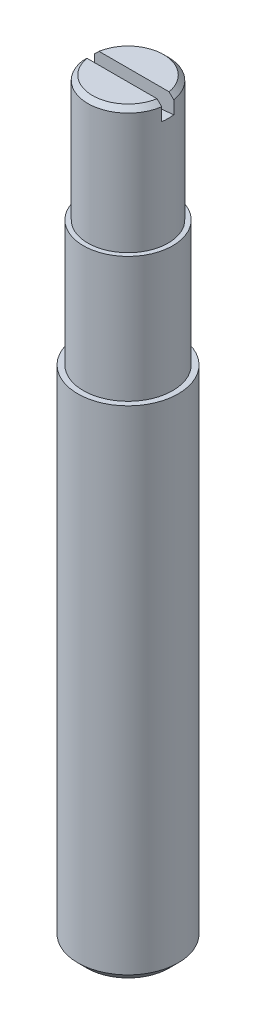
ISO-10303-21;
HEADER;
FILE_DESCRIPTION(('STEP AP214'),'2;1');
FILE_NAME('part.step','',(''),(''),'','','');
FILE_SCHEMA(('AUTOMOTIVE_DESIGN { 1 0 10303 214 1 1 1 1 }'));
ENDSEC;
DATA;
#1=APPLICATION_CONTEXT('core data for automotive mechanical design processes');
#2=APPLICATION_PROTOCOL_DEFINITION('international standard','automotive_design',2000,#1);
#3=PRODUCT_CONTEXT('',#1,'mechanical');
#4=PRODUCT('Part','Part','',(#3));
#5=PRODUCT_RELATED_PRODUCT_CATEGORY('part','',(#4));
#6=PRODUCT_DEFINITION_FORMATION('','',#4);
#7=PRODUCT_DEFINITION_CONTEXT('part definition',#1,'design');
#8=PRODUCT_DEFINITION('design','',#6,#7);
#9=PRODUCT_DEFINITION_SHAPE('','',#8);
#10=(LENGTH_UNIT() NAMED_UNIT(*) SI_UNIT(.MILLI.,.METRE.));
#11=(NAMED_UNIT(*) PLANE_ANGLE_UNIT() SI_UNIT($,.RADIAN.));
#12=(NAMED_UNIT(*) SI_UNIT($,.STERADIAN.) SOLID_ANGLE_UNIT());
#13=UNCERTAINTY_MEASURE_WITH_UNIT(LENGTH_MEASURE(1.E-05),#10,'distance_accuracy_value','');
#14=(GEOMETRIC_REPRESENTATION_CONTEXT(3) GLOBAL_UNCERTAINTY_ASSIGNED_CONTEXT((#13)) GLOBAL_UNIT_ASSIGNED_CONTEXT((#10,
#11,#12)) REPRESENTATION_CONTEXT('',''));
#15=CARTESIAN_POINT('',(0.,0.,0.));
#16=DIRECTION('',(0.,0.,1.));
#17=DIRECTION('',(1.,0.,0.));
#18=AXIS2_PLACEMENT_3D('',#15,#16,#17);
#19=CARTESIAN_POINT('',(0.,50.,0.));
#20=DIRECTION('',(0.,-1.,0.));
#21=DIRECTION('',(0.,0.,-1.));
#22=AXIS2_PLACEMENT_3D('',#19,#20,#21);
#23=PLANE('',#22);
#24=CARTESIAN_POINT('',(0.,50.0000000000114,0.));
#25=DIRECTION('',(0.,-1.,0.));
#26=DIRECTION('',(0.,0.,-1.));
#27=AXIS2_PLACEMENT_3D('',#24,#25,#26);
#28=CIRCLE('',#27,3.53999999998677);
#29=CARTESIAN_POINT('',(-3.48878202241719,50.0000000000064,-0.6));
#30=VERTEX_POINT('',#29);
#31=CARTESIAN_POINT('',(3.48878202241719,50.0000000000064,-0.6));
#32=VERTEX_POINT('',#31);
#33=EDGE_CURVE('E165',#30,#32,#28,.T.);
#34=ORIENTED_EDGE('',*,*,#33,.F.);
#35=DIRECTION('',(1.,0.,0.));
#36=VECTOR('',#35,1.);
#37=CARTESIAN_POINT('',(0.,50.,-0.6));
#38=LINE('',#37,#36);
#39=EDGE_CURVE('E163',#32,#30,#38,.F.);
#40=ORIENTED_EDGE('',*,*,#39,.F.);
#41=EDGE_LOOP('',(#34,#40));
#42=FACE_BOUND('',#41,.T.);
#43=ADVANCED_FACE('F14',(#42),#23,.F.);
#44=CARTESIAN_POINT('',(0.,50.,0.));
#45=DIRECTION('',(0.,-1.,0.));
#46=DIRECTION('',(0.,0.,-1.));
#47=AXIS2_PLACEMENT_3D('',#44,#45,#46);
#48=PLANE('',#47);
#49=DIRECTION('',(1.,0.,0.));
#50=VECTOR('',#49,1.);
#51=CARTESIAN_POINT('',(0.,50.,0.6));
#52=LINE('',#51,#50);
#53=CARTESIAN_POINT('',(-3.48878202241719,50.0000000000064,0.6));
#54=VERTEX_POINT('',#53);
#55=CARTESIAN_POINT('',(3.48878202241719,50.0000000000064,0.6));
#56=VERTEX_POINT('',#55);
#57=EDGE_CURVE('E161',#54,#56,#52,.T.);
#58=ORIENTED_EDGE('',*,*,#57,.F.);
#59=CARTESIAN_POINT('',(0.,50.0000000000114,0.));
#60=DIRECTION('',(0.,-1.,0.));
#61=DIRECTION('',(0.,0.,-1.));
#62=AXIS2_PLACEMENT_3D('',#59,#60,#61);
#63=CIRCLE('',#62,3.53999999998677);
#64=EDGE_CURVE('E159',#56,#54,#63,.T.);
#65=ORIENTED_EDGE('',*,*,#64,.F.);
#66=EDGE_LOOP('',(#58,#65));
#67=FACE_BOUND('',#66,.T.);
#68=ADVANCED_FACE('F121',(#67),#48,.F.);
#69=CARTESIAN_POINT('',(0.,49.5399999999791,0.));
#70=DIRECTION('',(0.,-1.,0.));
#71=DIRECTION('',(0.,0.,-1.));
#72=AXIS2_PLACEMENT_3D('',#69,#70,#71);
#73=CONICAL_SURFACE('',#72,3.99999999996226,0.785398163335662);
#74=CARTESIAN_POINT('',(-3.48878202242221,50.0000000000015,-0.6));
#75=CARTESIAN_POINT('',(-3.56650335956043,49.9233951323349,-0.6));
#76=CARTESIAN_POINT('',(-3.64419419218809,49.8467593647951,-0.6));
#77=CARTESIAN_POINT('',(-3.79951484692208,49.6934260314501,-0.6));
#78=CARTESIAN_POINT('',(-3.87714466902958,49.6167284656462,-0.6));
#79=CARTESIAN_POINT('',(-3.9547439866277,49.5399999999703,-0.6));
#80=B_SPLINE_CURVE_WITH_KNOTS('',3,(#74,#75,#76,#77,#78,#79),.UNSPECIFIED.,.F.,.F.,(4,2,4),(0.,
0.327383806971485,0.654767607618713),.UNSPECIFIED.);
#81=CARTESIAN_POINT('',(-3.95474398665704,49.5399999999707,-0.6));
#82=VERTEX_POINT('',#81);
#83=EDGE_CURVE('E39',#30,#82,#80,.T.);
#84=ORIENTED_EDGE('',*,*,#83,.F.);
#85=ORIENTED_EDGE('',*,*,#33,.T.);
#86=CARTESIAN_POINT('',(3.95474398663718,49.5399999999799,-0.600000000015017));
#87=CARTESIAN_POINT('',(3.87714466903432,49.616728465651,-0.600000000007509));
#88=CARTESIAN_POINT('',(3.79951484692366,49.6934260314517,-0.600000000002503));
#89=CARTESIAN_POINT('',(3.64419419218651,49.8467593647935,-0.599999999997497));
#90=CARTESIAN_POINT('',(3.56650335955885,49.9233951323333,-0.599999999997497));
#91=CARTESIAN_POINT('',(3.48878202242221,50.0000000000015,-0.6));
#92=B_SPLINE_CURVE_WITH_KNOTS('',3,(#86,#87,#88,#89,#90,#91),.UNSPECIFIED.,.F.,.F.,(4,2,4),(0.,
0.327383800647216,0.654767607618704),.UNSPECIFIED.);
#93=CARTESIAN_POINT('',(3.95474398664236,49.5399999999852,-0.6));
#94=VERTEX_POINT('',#93);
#95=EDGE_CURVE('E134',#94,#32,#92,.T.);
#96=ORIENTED_EDGE('',*,*,#95,.F.);
#97=CARTESIAN_POINT('',(0.,49.54,0.));
#98=DIRECTION('',(0.,-1.,0.));
#99=DIRECTION('',(0.,0.,-1.));
#100=AXIS2_PLACEMENT_3D('',#97,#98,#99);
#101=CIRCLE('',#100,4.);
#102=EDGE_CURVE('E175',#82,#94,#101,.T.);
#103=ORIENTED_EDGE('',*,*,#102,.F.);
#104=EDGE_LOOP('',(#84,#85,#96,#103));
#105=FACE_BOUND('',#104,.T.);
#106=ADVANCED_FACE('F116',(#105),#73,.T.);
#107=CARTESIAN_POINT('',(0.,79.5,-0.6));
#108=DIRECTION('',(0.,0.,1.));
#109=DIRECTION('',(1.,0.,0.));
#110=AXIS2_PLACEMENT_3D('',#107,#108,#109);
#111=PLANE('',#110);
#112=ORIENTED_EDGE('',*,*,#39,.T.);
#113=ORIENTED_EDGE('',*,*,#83,.T.);
#114=DIRECTION('',(0.,1.,0.));
#115=VECTOR('',#114,1.);
#116=CARTESIAN_POINT('',(-3.95474398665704,79.5,-0.6));
#117=LINE('',#116,#115);
#118=CARTESIAN_POINT('',(-3.95474398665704,48.2492400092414,-0.6));
#119=VERTEX_POINT('',#118);
#120=EDGE_CURVE('E154',#82,#119,#117,.F.);
#121=ORIENTED_EDGE('',*,*,#120,.T.);
#122=CARTESIAN_POINT('',(0.,79.5,-0.6));
#123=DIRECTION('',(0.,0.,-1.));
#124=DIRECTION('',(-1.,0.,0.));
#125=AXIS2_PLACEMENT_3D('',#122,#123,#124);
#126=CIRCLE('',#125,31.5);
#127=CARTESIAN_POINT('',(3.95474398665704,48.2492400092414,-0.6));
#128=VERTEX_POINT('',#127);
#129=EDGE_CURVE('E89',#119,#128,#126,.F.);
#130=ORIENTED_EDGE('',*,*,#129,.T.);
#131=DIRECTION('',(0.,1.,0.));
#132=VECTOR('',#131,1.);
#133=CARTESIAN_POINT('',(3.95474398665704,79.5,-0.6));
#134=LINE('',#133,#132);
#135=EDGE_CURVE('E140',#128,#94,#134,.T.);
#136=ORIENTED_EDGE('',*,*,#135,.T.);
#137=ORIENTED_EDGE('',*,*,#95,.T.);
#138=EDGE_LOOP('',(#112,#113,#121,#130,#136,#137));
#139=FACE_BOUND('',#138,.T.);
#140=ADVANCED_FACE('F120',(#139),#111,.T.);
#141=CARTESIAN_POINT('',(0.,49.5399999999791,0.));
#142=DIRECTION('',(0.,-1.,0.));
#143=DIRECTION('',(0.,0.,-1.));
#144=AXIS2_PLACEMENT_3D('',#141,#142,#143);
#145=CONICAL_SURFACE('',#144,3.99999999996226,0.785398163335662);
#146=ORIENTED_EDGE('',*,*,#64,.T.);
#147=CARTESIAN_POINT('',(-3.48878202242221,50.0000000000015,0.6));
#148=CARTESIAN_POINT('',(-3.56650335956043,49.9233951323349,0.6));
#149=CARTESIAN_POINT('',(-3.64419419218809,49.8467593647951,0.6));
#150=CARTESIAN_POINT('',(-3.79951484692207,49.6934260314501,0.6));
#151=CARTESIAN_POINT('',(-3.87714466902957,49.6167284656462,0.6));
#152=CARTESIAN_POINT('',(-3.95474398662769,49.5399999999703,0.6));
#153=B_SPLINE_CURVE_WITH_KNOTS('',3,(#147,#148,#149,#150,#151,#152),.UNSPECIFIED.,.F.,.F.,(4,2,
4),(0.,0.327383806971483,0.654767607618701),.UNSPECIFIED.);
#154=CARTESIAN_POINT('',(-3.95474398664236,49.5399999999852,0.6));
#155=VERTEX_POINT('',#154);
#156=EDGE_CURVE('E149',#54,#155,#153,.T.);
#157=ORIENTED_EDGE('',*,*,#156,.T.);
#158=CARTESIAN_POINT('',(0.,49.54,0.));
#159=DIRECTION('',(0.,-1.,0.));
#160=DIRECTION('',(0.,0.,-1.));
#161=AXIS2_PLACEMENT_3D('',#158,#159,#160);
#162=CIRCLE('',#161,4.);
#163=CARTESIAN_POINT('',(3.95474398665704,49.5399999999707,0.6));
#164=VERTEX_POINT('',#163);
#165=EDGE_CURVE('E79',#164,#155,#162,.T.);
#166=ORIENTED_EDGE('',*,*,#165,.F.);
#167=CARTESIAN_POINT('',(3.95474398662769,49.5399999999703,0.6));
#168=CARTESIAN_POINT('',(3.87714466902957,49.6167284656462,0.6));
#169=CARTESIAN_POINT('',(3.79951484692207,49.6934260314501,0.6));
#170=CARTESIAN_POINT('',(3.64419419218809,49.8467593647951,0.6));
#171=CARTESIAN_POINT('',(3.56650335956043,49.9233951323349,0.6));
#172=CARTESIAN_POINT('',(3.48878202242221,50.0000000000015,0.6));
#173=B_SPLINE_CURVE_WITH_KNOTS('',3,(#167,#168,#169,#170,#171,#172),.UNSPECIFIED.,.F.,.F.,(4,2,
4),(0.,0.327383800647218,0.654767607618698),.UNSPECIFIED.);
#174=EDGE_CURVE('E97',#164,#56,#173,.T.);
#175=ORIENTED_EDGE('',*,*,#174,.T.);
#176=EDGE_LOOP('',(#146,#157,#166,#175));
#177=FACE_BOUND('',#176,.T.);
#178=ADVANCED_FACE('F122',(#177),#145,.T.);
#179=CARTESIAN_POINT('',(0.,79.5,0.6));
#180=DIRECTION('',(0.,0.,1.));
#181=DIRECTION('',(1.,0.,0.));
#182=AXIS2_PLACEMENT_3D('',#179,#180,#181);
#183=PLANE('',#182);
#184=ORIENTED_EDGE('',*,*,#57,.T.);
#185=ORIENTED_EDGE('',*,*,#174,.F.);
#186=DIRECTION('',(0.,1.,0.));
#187=VECTOR('',#186,1.);
#188=CARTESIAN_POINT('',(3.95474398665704,79.5,0.6));
#189=LINE('',#188,#187);
#190=CARTESIAN_POINT('',(3.95474398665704,48.2492400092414,0.6));
#191=VERTEX_POINT('',#190);
#192=EDGE_CURVE('E95',#191,#164,#189,.T.);
#193=ORIENTED_EDGE('',*,*,#192,.F.);
#194=CARTESIAN_POINT('',(0.,79.5,0.6));
#195=DIRECTION('',(0.,0.,-1.));
#196=DIRECTION('',(-1.,0.,0.));
#197=AXIS2_PLACEMENT_3D('',#194,#195,#196);
#198=CIRCLE('',#197,31.5);
#199=CARTESIAN_POINT('',(-3.95474398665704,48.2492400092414,0.6));
#200=VERTEX_POINT('',#199);
#201=EDGE_CURVE('E82',#200,#191,#198,.F.);
#202=ORIENTED_EDGE('',*,*,#201,.F.);
#203=DIRECTION('',(0.,1.,0.));
#204=VECTOR('',#203,1.);
#205=CARTESIAN_POINT('',(-3.95474398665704,79.5,0.6));
#206=LINE('',#205,#204);
#207=EDGE_CURVE('E73',#155,#200,#206,.F.);
#208=ORIENTED_EDGE('',*,*,#207,.F.);
#209=ORIENTED_EDGE('',*,*,#156,.F.);
#210=EDGE_LOOP('',(#184,#185,#193,#202,#208,#209));
#211=FACE_BOUND('',#210,.T.);
#212=ADVANCED_FACE('F93',(#211),#183,.F.);
#213=CARTESIAN_POINT('',(0.,79.5,0.6));
#214=DIRECTION('',(0.,0.,-1.));
#215=DIRECTION('',(-1.,0.,0.));
#216=AXIS2_PLACEMENT_3D('',#213,#214,#215);
#217=CYLINDRICAL_SURFACE('',#216,31.5);
#218=CARTESIAN_POINT('',(3.95474398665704,48.2492400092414,-0.6));
#219=CARTESIAN_POINT('',(3.96984984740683,48.2511544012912,-0.500484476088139));
#220=CARTESIAN_POINT('',(3.98118553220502,48.2525972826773,-0.40038868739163));
#221=CARTESIAN_POINT('',(3.9962389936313,48.2545175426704,-0.20019306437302));
#222=CARTESIAN_POINT('',(4.,48.2550004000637,-0.10009653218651));
#223=CARTESIAN_POINT('',(4.,48.2550004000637,0.10009653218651));
#224=CARTESIAN_POINT('',(3.9962389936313,48.2545175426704,0.20019306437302));
#225=CARTESIAN_POINT('',(3.98118553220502,48.2525972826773,0.40038868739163));
#226=CARTESIAN_POINT('',(3.96984984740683,48.2511544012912,0.500484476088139));
#227=CARTESIAN_POINT('',(3.95474398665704,48.2492400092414,0.6));
#228=B_SPLINE_CURVE_WITH_KNOTS('',3,(#218,#219,#220,#221,#222,#223,#224,#225,#226,#227),
.UNSPECIFIED.,.F.,.F.,(4,2,2,2,4),(0.,0.301946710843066,0.602165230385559,0.902383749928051,
1.20433046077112),.UNSPECIFIED.);
#229=EDGE_CURVE('E83',#128,#191,#228,.T.);
#230=ORIENTED_EDGE('',*,*,#229,.F.);
#231=ORIENTED_EDGE('',*,*,#129,.F.);
#232=CARTESIAN_POINT('',(-3.95474398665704,48.2492400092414,0.6));
#233=CARTESIAN_POINT('',(-3.96984984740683,48.2511544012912,0.500484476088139));
#234=CARTESIAN_POINT('',(-3.98118553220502,48.2525972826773,0.40038868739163));
#235=CARTESIAN_POINT('',(-3.9962389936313,48.2545175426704,0.20019306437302));
#236=CARTESIAN_POINT('',(-4.,48.2550004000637,0.10009653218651));
#237=CARTESIAN_POINT('',(-4.,48.2550004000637,-0.10009653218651));
#238=CARTESIAN_POINT('',(-3.9962389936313,48.2545175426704,-0.20019306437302));
#239=CARTESIAN_POINT('',(-3.98118553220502,48.2525972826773,-0.40038868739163));
#240=CARTESIAN_POINT('',(-3.96984984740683,48.2511544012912,-0.500484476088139));
#241=CARTESIAN_POINT('',(-3.95474398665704,48.2492400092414,-0.6));
#242=B_SPLINE_CURVE_WITH_KNOTS('',3,(#232,#233,#234,#235,#236,#237,#238,#239,#240,#241),
.UNSPECIFIED.,.F.,.F.,(4,2,2,2,4),(0.,0.301946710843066,0.602165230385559,0.902383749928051,
1.20433046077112),.UNSPECIFIED.);
#243=EDGE_CURVE('E19',#200,#119,#242,.T.);
#244=ORIENTED_EDGE('',*,*,#243,.F.);
#245=ORIENTED_EDGE('',*,*,#201,.T.);
#246=EDGE_LOOP('',(#230,#231,#244,#245));
#247=FACE_BOUND('',#246,.T.);
#248=ADVANCED_FACE('F16',(#247),#217,.F.);
#249=CARTESIAN_POINT('',(0.,37.5,0.));
#250=DIRECTION('',(0.,-1.,0.));
#251=DIRECTION('',(0.,0.,-1.));
#252=AXIS2_PLACEMENT_3D('',#249,#250,#251);
#253=CYLINDRICAL_SURFACE('',#252,4.);
#254=ORIENTED_EDGE('',*,*,#229,.T.);
#255=ORIENTED_EDGE('',*,*,#192,.T.);
#256=ORIENTED_EDGE('',*,*,#165,.T.);
#257=ORIENTED_EDGE('',*,*,#207,.T.);
#258=ORIENTED_EDGE('',*,*,#243,.T.);
#259=ORIENTED_EDGE('',*,*,#120,.F.);
#260=ORIENTED_EDGE('',*,*,#102,.T.);
#261=ORIENTED_EDGE('',*,*,#135,.F.);
#262=EDGE_LOOP('',(#254,#255,#256,#257,#258,#259,#260,#261));
#263=FACE_BOUND('',#262,.T.);
#264=CARTESIAN_POINT('',(0.,37.5,0.));
#265=DIRECTION('',(0.,-1.,0.));
#266=DIRECTION('',(0.,0.,-1.));
#267=AXIS2_PLACEMENT_3D('',#264,#265,#266);
#268=CIRCLE('',#267,4.);
#269=CARTESIAN_POINT('',(0.,37.5,-4.));
#270=VERTEX_POINT('',#269);
#271=EDGE_CURVE('E171',#270,#270,#268,.F.);
#272=ORIENTED_EDGE('',*,*,#271,.T.);
#273=EDGE_LOOP('',(#272));
#274=FACE_BOUND('',#273,.T.);
#275=ADVANCED_FACE('F75',(#263,#274),#253,.T.);
#276=CARTESIAN_POINT('',(0.,37.5,0.));
#277=DIRECTION('',(0.,-1.,0.));
#278=DIRECTION('',(0.,0.,-1.));
#279=AXIS2_PLACEMENT_3D('',#276,#277,#278);
#280=PLANE('',#279);
#281=ORIENTED_EDGE('',*,*,#271,.F.);
#282=EDGE_LOOP('',(#281));
#283=FACE_BOUND('',#282,.T.);
#284=CARTESIAN_POINT('',(0.,37.5,0.));
#285=DIRECTION('',(0.,-1.,0.));
#286=DIRECTION('',(0.,0.,-1.));
#287=AXIS2_PLACEMENT_3D('',#284,#285,#286);
#288=CIRCLE('',#287,4.45);
#289=CARTESIAN_POINT('',(0.,37.5,-4.45));
#290=VERTEX_POINT('',#289);
#291=EDGE_CURVE('E174',#290,#290,#288,.T.);
#292=ORIENTED_EDGE('',*,*,#291,.F.);
#293=EDGE_LOOP('',(#292));
#294=FACE_BOUND('',#293,.T.);
#295=ADVANCED_FACE('F114',(#283,#294),#280,.F.);
#296=CARTESIAN_POINT('',(0.,25.,0.));
#297=DIRECTION('',(0.,-1.,0.));
#298=DIRECTION('',(0.,0.,-1.));
#299=AXIS2_PLACEMENT_3D('',#296,#297,#298);
#300=CYLINDRICAL_SURFACE('',#299,4.45);
#301=ORIENTED_EDGE('',*,*,#291,.T.);
#302=EDGE_LOOP('',(#301));
#303=FACE_BOUND('',#302,.T.);
#304=CARTESIAN_POINT('',(0.,25.,0.));
#305=DIRECTION('',(0.,-1.,0.));
#306=DIRECTION('',(0.,0.,-1.));
#307=AXIS2_PLACEMENT_3D('',#304,#305,#306);
#308=CIRCLE('',#307,4.45);
#309=CARTESIAN_POINT('',(0.,25.,-4.45));
#310=VERTEX_POINT('',#309);
#311=EDGE_CURVE('E30',#310,#310,#308,.F.);
#312=ORIENTED_EDGE('',*,*,#311,.T.);
#313=EDGE_LOOP('',(#312));
#314=FACE_BOUND('',#313,.T.);
#315=ADVANCED_FACE('F218',(#303,#314),#300,.T.);
#316=CARTESIAN_POINT('',(0.,25.,0.));
#317=DIRECTION('',(0.,-1.,0.));
#318=DIRECTION('',(0.,0.,-1.));
#319=AXIS2_PLACEMENT_3D('',#316,#317,#318);
#320=PLANE('',#319);
#321=ORIENTED_EDGE('',*,*,#311,.F.);
#322=EDGE_LOOP('',(#321));
#323=FACE_BOUND('',#322,.T.);
#324=CARTESIAN_POINT('',(0.,25.,0.));
#325=DIRECTION('',(0.,-1.,0.));
#326=DIRECTION('',(0.,0.,-1.));
#327=AXIS2_PLACEMENT_3D('',#324,#325,#326);
#328=CIRCLE('',#327,5.);
#329=CARTESIAN_POINT('',(0.,25.,-5.));
#330=VERTEX_POINT('',#329);
#331=EDGE_CURVE('E9',#330,#330,#328,.T.);
#332=ORIENTED_EDGE('',*,*,#331,.F.);
#333=EDGE_LOOP('',(#332));
#334=FACE_BOUND('',#333,.T.);
#335=ADVANCED_FACE('F213',(#323,#334),#320,.F.);
#336=CARTESIAN_POINT('',(0.,0.,0.));
#337=DIRECTION('',(0.,-1.,0.));
#338=DIRECTION('',(0.,0.,-1.));
#339=AXIS2_PLACEMENT_3D('',#336,#337,#338);
#340=CYLINDRICAL_SURFACE('',#339,5.);
#341=ORIENTED_EDGE('',*,*,#331,.T.);
#342=EDGE_LOOP('',(#341));
#343=FACE_BOUND('',#342,.T.);
#344=CARTESIAN_POINT('',(0.,-24.08,0.));
#345=DIRECTION('',(0.,-1.,0.));
#346=DIRECTION('',(0.,0.,-1.));
#347=AXIS2_PLACEMENT_3D('',#344,#345,#346);
#348=CIRCLE('',#347,5.);
#349=CARTESIAN_POINT('',(0.,-24.08,-5.));
#350=VERTEX_POINT('',#349);
#351=EDGE_CURVE('E191',#350,#350,#348,.F.);
#352=ORIENTED_EDGE('',*,*,#351,.T.);
#353=EDGE_LOOP('',(#352));
#354=FACE_BOUND('',#353,.T.);
#355=ADVANCED_FACE('F203',(#343,#354),#340,.T.);
#356=CARTESIAN_POINT('',(4.08,-25.,0.));
#357=DIRECTION('',(0.,1.,0.));
#358=DIRECTION('',(0.,0.,1.));
#359=AXIS2_PLACEMENT_3D('',#356,#357,#358);
#360=PLANE('',#359);
#361=CARTESIAN_POINT('',(0.,-24.9999999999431,0.));
#362=DIRECTION('',(0.,1.,0.));
#363=DIRECTION('',(0.,0.,1.));
#364=AXIS2_PLACEMENT_3D('',#361,#362,#363);
#365=CIRCLE('',#364,4.07999999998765);
#366=CARTESIAN_POINT('',(0.,-24.9999999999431,4.07999999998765));
#367=VERTEX_POINT('',#366);
#368=EDGE_CURVE('E91',#367,#367,#365,.T.);
#369=ORIENTED_EDGE('',*,*,#368,.F.);
#370=EDGE_LOOP('',(#369));
#371=FACE_BOUND('',#370,.T.);
#372=ADVANCED_FACE('F201',(#371),#360,.F.);
#373=CARTESIAN_POINT('',(0.,-24.0799999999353,0.));
#374=DIRECTION('',(0.,1.,0.));
#375=DIRECTION('',(0.,0.,1.));
#376=AXIS2_PLACEMENT_3D('',#373,#374,#375);
#377=CONICAL_SURFACE('',#376,4.99999999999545,0.785398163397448);
#378=ORIENTED_EDGE('',*,*,#351,.F.);
#379=EDGE_LOOP('',(#378));
#380=FACE_BOUND('',#379,.T.);
#381=ORIENTED_EDGE('',*,*,#368,.T.);
#382=EDGE_LOOP('',(#381));
#383=FACE_BOUND('',#382,.T.);
#384=ADVANCED_FACE('F199',(#380,#383),#377,.T.);
#385=CLOSED_SHELL('',(#43,#68,#106,#140,#178,#212,#248,#275,#295,#315,#335,#355,#372,#384));
#386=MANIFOLD_SOLID_BREP('B1',#385);
#387=ADVANCED_BREP_SHAPE_REPRESENTATION('',(#18,#386),#14);
#388=SHAPE_DEFINITION_REPRESENTATION(#9,#387);
ENDSEC;
END-ISO-10303-21;
